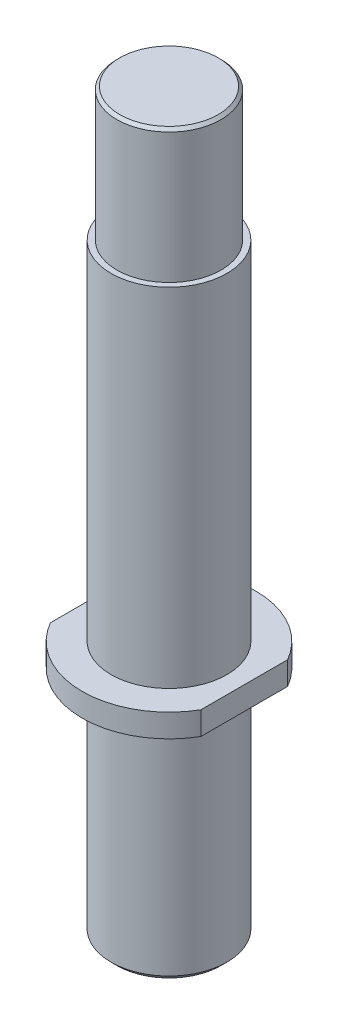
from build123d import *

# Parameters (mm, degrees)
CROQUIS1_R              = 10
SALIENTE_EXTRUIR1_DEPTH = 40
CROQUIS2_R              = 15
SALIENTE_EXTRUIR2_DEPTH = 4
CORTAR_EXTRUIR1_DEPTH   = 4
CHAFL_N1_SIZE           = 1
CROQUIS4_R              = 5
CORTAR_EXTRUIR2_DEPTH   = 34
CHAFL_N2_SIZE           = 0.5
CROQUIS6_R              = 10
SALIENTE_EXTRUIR3_DEPTH = 60
CROQUIS7_R              = 9
SALIENTE_EXTRUIR4_DEPTH = 23
CHAFL_N3_SIZE           = 0.5


with BuildPart() as part:
    # Croquis1 → Saliente-Extruir1 (new body)
    with BuildSketch(Plane(origin=(0, 0, 0), x_dir=(1, 0, 0), z_dir=(0, 1, 0))):
        with Locations(Location((0, 0, 0), (0, 0, 270))):
            Circle(CROQUIS1_R)
    extrude(amount=SALIENTE_EXTRUIR1_DEPTH)

    # Croquis2 → Saliente-Extruir2 (add)
    with BuildSketch(Plane(origin=(0, 40, 0), x_dir=(1, 0, 0), z_dir=(0, 1, 0))):
        with Locations(Location((0, 0, 0), (0, 0, 270))):
            Circle(CROQUIS2_R)
    extrude(amount=SALIENTE_EXTRUIR2_DEPTH)

    # Croquis3 → Cortar-Extruir1 (cut)
    with BuildSketch(Plane(origin=(0, 44, 0), x_dir=(1, 0, 0), z_dir=(0, 1, 0))):
        Polygon((13, 20.932052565), (28.484539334, -2.722105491), (13, -24.029620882), align=None)
        Polygon((-13, 20.932052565), (-13, -24.029620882), (-34.491944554, -2.722105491), align=None)
    extrude(amount=-CORTAR_EXTRUIR1_DEPTH, mode=Mode.SUBTRACT)

    # Chafl_n1
    chafl_n1_edges = [part.edges().sort_by_distance(p)[0] for p in [
        (0, 0, -10),
    ]]
    chamfer(chafl_n1_edges, length=CHAFL_N1_SIZE)

    # Croquis4 → Cortar-Extruir2 (cut)
    with BuildSketch(Plane.XZ):
        with Locations(Location((0, 0, 0), (0, 0, 270))):
            Circle(CROQUIS4_R)
    extrude(amount=-CORTAR_EXTRUIR2_DEPTH, mode=Mode.SUBTRACT)

    # Chafl_n2
    chafl_n2_edges = [part.edges().sort_by_distance(p)[0] for p in [
        (0, 0, 5),
    ]]
    chamfer(chafl_n2_edges, length=CHAFL_N2_SIZE)

    # Cortar-Extruir3 cone 1 section (on through the dimple's axis) → Cortar-Extruir3 (revolve, cut)
    with BuildSketch(Plane(origin=(0, 34, 0), x_dir=(0, 0, -1), z_dir=(1, 0, 0))):
        Polygon((0, 0), (5, 0), (0, 1.528653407), align=None)
    revolve(axis=Axis((0, 34, 0), (0, 1, 0)), mode=Mode.SUBTRACT)

    # Croquis6 → Saliente-Extruir3 (add)
    with BuildSketch(Plane(origin=(0, 44, 0), x_dir=(1, 0, 0), z_dir=(0, 1, 0))):
        with Locations(Location((0, 0, 0), (0, 0, 270))):
            Circle(CROQUIS6_R)
    extrude(amount=SALIENTE_EXTRUIR3_DEPTH)

    # Croquis7 → Saliente-Extruir4 (add)
    with BuildSketch(Plane(origin=(0, 104, 0), x_dir=(1, 0, 0), z_dir=(0, 1, 0))):
        with Locations(Location((0, 0, 0), (0, 0, 270))):
            Circle(CROQUIS7_R)
    extrude(amount=SALIENTE_EXTRUIR4_DEPTH)

    # Chafl_n3
    chafl_n3_edges = [part.edges().sort_by_distance(p)[0] for p in [
        (0, 127, -9),
    ]]
    chamfer(chafl_n3_edges, length=CHAFL_N3_SIZE)


solid = part.part
